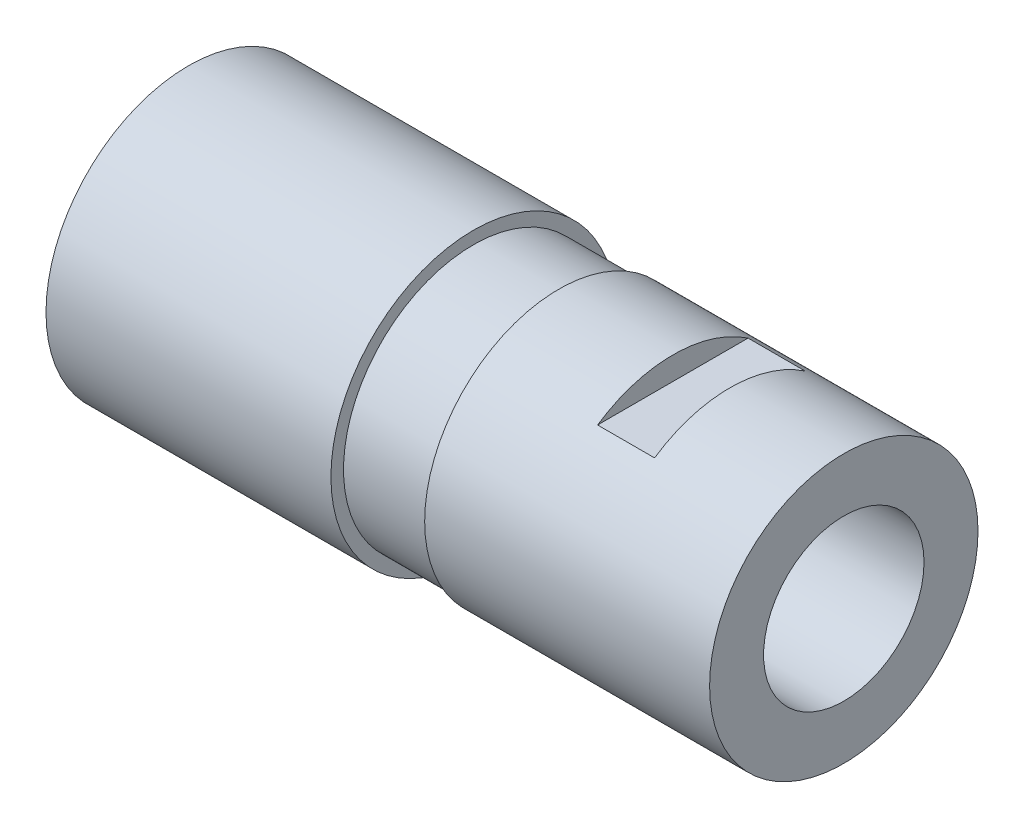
ISO-10303-21;
HEADER;
FILE_DESCRIPTION(('STEP AP214'),'2;1');
FILE_NAME('part.step','',(''),(''),'','','');
FILE_SCHEMA(('AUTOMOTIVE_DESIGN { 1 0 10303 214 1 1 1 1 }'));
ENDSEC;
DATA;
#1=APPLICATION_CONTEXT('core data for automotive mechanical design processes');
#2=APPLICATION_PROTOCOL_DEFINITION('international standard','automotive_design',2000,#1);
#3=PRODUCT_CONTEXT('',#1,'mechanical');
#4=PRODUCT('Part','Part','',(#3));
#5=PRODUCT_RELATED_PRODUCT_CATEGORY('part','',(#4));
#6=PRODUCT_DEFINITION_FORMATION('','',#4);
#7=PRODUCT_DEFINITION_CONTEXT('part definition',#1,'design');
#8=PRODUCT_DEFINITION('design','',#6,#7);
#9=PRODUCT_DEFINITION_SHAPE('','',#8);
#10=(LENGTH_UNIT() NAMED_UNIT(*) SI_UNIT(.MILLI.,.METRE.));
#11=(NAMED_UNIT(*) PLANE_ANGLE_UNIT() SI_UNIT($,.RADIAN.));
#12=(NAMED_UNIT(*) SI_UNIT($,.STERADIAN.) SOLID_ANGLE_UNIT());
#13=UNCERTAINTY_MEASURE_WITH_UNIT(LENGTH_MEASURE(1.E-05),#10,'distance_accuracy_value','');
#14=(GEOMETRIC_REPRESENTATION_CONTEXT(3) GLOBAL_UNCERTAINTY_ASSIGNED_CONTEXT((#13)) GLOBAL_UNIT_ASSIGNED_CONTEXT((#10,
#11,#12)) REPRESENTATION_CONTEXT('',''));
#15=CARTESIAN_POINT('',(0.,0.,0.));
#16=DIRECTION('',(0.,0.,1.));
#17=DIRECTION('',(1.,0.,0.));
#18=AXIS2_PLACEMENT_3D('',#15,#16,#17);
#19=CARTESIAN_POINT('',(2.57998034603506,0.,0.));
#20=DIRECTION('',(1.,0.,0.));
#21=DIRECTION('',(0.,0.,-1.));
#22=AXIS2_PLACEMENT_3D('',#19,#20,#21);
#23=CYLINDRICAL_SURFACE('',#22,5.9817);
#24=DIRECTION('',(1.,0.,0.));
#25=VECTOR('',#24,1.);
#26=CARTESIAN_POINT('',(2.57998034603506,4.953,3.35388221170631));
#27=LINE('',#26,#25);
#28=CARTESIAN_POINT('',(-7.62,4.953,3.35388221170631));
#29=VERTEX_POINT('',#28);
#30=CARTESIAN_POINT('',(-5.08,4.953,3.35388221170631));
#31=VERTEX_POINT('',#30);
#32=EDGE_CURVE('E57',#29,#31,#27,.T.);
#33=ORIENTED_EDGE('',*,*,#32,.F.);
#34=CARTESIAN_POINT('',(-7.61999999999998,0.,0.));
#35=DIRECTION('',(1.,0.,0.));
#36=DIRECTION('',(0.,1.,0.));
#37=AXIS2_PLACEMENT_3D('',#34,#35,#36);
#38=CIRCLE('',#37,5.9817);
#39=CARTESIAN_POINT('',(-7.62,4.953,-3.35388221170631));
#40=VERTEX_POINT('',#39);
#41=EDGE_CURVE('E102',#40,#29,#38,.T.);
#42=ORIENTED_EDGE('',*,*,#41,.F.);
#43=DIRECTION('',(1.,0.,0.));
#44=VECTOR('',#43,1.);
#45=CARTESIAN_POINT('',(2.57998034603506,4.953,-3.35388221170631));
#46=LINE('',#45,#44);
#47=CARTESIAN_POINT('',(-5.08,4.953,-3.35388221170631));
#48=VERTEX_POINT('',#47);
#49=EDGE_CURVE('E80',#40,#48,#46,.T.);
#50=ORIENTED_EDGE('',*,*,#49,.T.);
#51=CARTESIAN_POINT('',(-5.07999999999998,0.,0.));
#52=DIRECTION('',(-1.,0.,0.));
#53=DIRECTION('',(0.,-1.,0.));
#54=AXIS2_PLACEMENT_3D('',#51,#52,#53);
#55=CIRCLE('',#54,5.9817);
#56=EDGE_CURVE('E99',#31,#48,#55,.T.);
#57=ORIENTED_EDGE('',*,*,#56,.F.);
#58=EDGE_LOOP('',(#33,#42,#50,#57));
#59=FACE_BOUND('',#58,.T.);
#60=CARTESIAN_POINT('',(-12.7,0.,0.));
#61=DIRECTION('',(1.,0.,0.));
#62=DIRECTION('',(0.,0.,-1.));
#63=AXIS2_PLACEMENT_3D('',#60,#61,#62);
#64=CIRCLE('',#63,5.9817);
#65=CARTESIAN_POINT('',(-12.7,0.,-5.9817));
#66=VERTEX_POINT('',#65);
#67=EDGE_CURVE('E130',#66,#66,#64,.T.);
#68=ORIENTED_EDGE('',*,*,#67,.T.);
#69=EDGE_LOOP('',(#68));
#70=FACE_BOUND('',#69,.T.);
#71=CARTESIAN_POINT('',(0.,0.,0.));
#72=DIRECTION('',(1.,0.,0.));
#73=DIRECTION('',(0.,0.,-1.));
#74=AXIS2_PLACEMENT_3D('',#71,#72,#73);
#75=CIRCLE('',#74,5.9817);
#76=CARTESIAN_POINT('',(0.,0.,-5.9817));
#77=VERTEX_POINT('',#76);
#78=EDGE_CURVE('E43',#77,#77,#75,.T.);
#79=ORIENTED_EDGE('',*,*,#78,.F.);
#80=EDGE_LOOP('',(#79));
#81=FACE_BOUND('',#80,.T.);
#82=CARTESIAN_POINT('',(-5.07999999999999,0.,0.));
#83=DIRECTION('',(-1.,0.,0.));
#84=DIRECTION('',(0.,-1.,0.));
#85=AXIS2_PLACEMENT_3D('',#82,#83,#84);
#86=CIRCLE('',#85,5.9817);
#87=CARTESIAN_POINT('',(-5.08,-4.953,-3.35388221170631));
#88=VERTEX_POINT('',#87);
#89=CARTESIAN_POINT('',(-5.08,-4.953,3.35388221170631));
#90=VERTEX_POINT('',#89);
#91=EDGE_CURVE('E49',#88,#90,#86,.T.);
#92=ORIENTED_EDGE('',*,*,#91,.F.);
#93=DIRECTION('',(1.,0.,0.));
#94=VECTOR('',#93,1.);
#95=CARTESIAN_POINT('',(2.57998034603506,-4.953,-3.35388221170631));
#96=LINE('',#95,#94);
#97=CARTESIAN_POINT('',(-7.62,-4.953,-3.35388221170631));
#98=VERTEX_POINT('',#97);
#99=EDGE_CURVE('E84',#88,#98,#96,.F.);
#100=ORIENTED_EDGE('',*,*,#99,.T.);
#101=CARTESIAN_POINT('',(-7.61999999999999,0.,0.));
#102=DIRECTION('',(1.,0.,0.));
#103=DIRECTION('',(0.,1.,0.));
#104=AXIS2_PLACEMENT_3D('',#101,#102,#103);
#105=CIRCLE('',#104,5.9817);
#106=CARTESIAN_POINT('',(-7.62,-4.953,3.35388221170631));
#107=VERTEX_POINT('',#106);
#108=EDGE_CURVE('E92',#107,#98,#105,.T.);
#109=ORIENTED_EDGE('',*,*,#108,.F.);
#110=DIRECTION('',(1.,0.,0.));
#111=VECTOR('',#110,1.);
#112=CARTESIAN_POINT('',(2.57998034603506,-4.953,3.35388221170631));
#113=LINE('',#112,#111);
#114=EDGE_CURVE('E90',#90,#107,#113,.F.);
#115=ORIENTED_EDGE('',*,*,#114,.F.);
#116=EDGE_LOOP('',(#92,#100,#109,#115));
#117=FACE_BOUND('',#116,.T.);
#118=ADVANCED_FACE('F35',(#59,#70,#81,#117),#23,.T.);
#119=CARTESIAN_POINT('',(2.57998034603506,0.,0.));
#120=DIRECTION('',(1.,0.,0.));
#121=DIRECTION('',(0.,0.,-1.));
#122=AXIS2_PLACEMENT_3D('',#119,#120,#121);
#123=CYLINDRICAL_SURFACE('',#122,3.57632);
#124=CARTESIAN_POINT('',(0.,0.,0.));
#125=DIRECTION('',(1.,0.,0.));
#126=DIRECTION('',(0.,0.,-1.));
#127=AXIS2_PLACEMENT_3D('',#124,#125,#126);
#128=CIRCLE('',#127,3.57632);
#129=CARTESIAN_POINT('',(0.,0.,-3.57632));
#130=VERTEX_POINT('',#129);
#131=EDGE_CURVE('E11',#130,#130,#128,.T.);
#132=ORIENTED_EDGE('',*,*,#131,.T.);
#133=EDGE_LOOP('',(#132));
#134=FACE_BOUND('',#133,.T.);
#135=CARTESIAN_POINT('',(-11.1125,0.,0.));
#136=DIRECTION('',(1.,0.,0.));
#137=DIRECTION('',(0.,0.,-1.));
#138=AXIS2_PLACEMENT_3D('',#135,#136,#137);
#139=CIRCLE('',#138,3.57632);
#140=CARTESIAN_POINT('',(-11.1125,0.,-3.57632));
#141=VERTEX_POINT('',#140);
#142=EDGE_CURVE('E109',#141,#141,#139,.T.);
#143=ORIENTED_EDGE('',*,*,#142,.F.);
#144=EDGE_LOOP('',(#143));
#145=FACE_BOUND('',#144,.T.);
#146=ADVANCED_FACE('F37',(#134,#145),#123,.F.);
#147=CARTESIAN_POINT('',(0.,3.57632,0.));
#148=DIRECTION('',(1.,0.,0.));
#149=DIRECTION('',(0.,0.,-1.));
#150=AXIS2_PLACEMENT_3D('',#147,#148,#149);
#151=PLANE('',#150);
#152=ORIENTED_EDGE('',*,*,#78,.T.);
#153=EDGE_LOOP('',(#152));
#154=FACE_BOUND('',#153,.T.);
#155=ORIENTED_EDGE('',*,*,#131,.F.);
#156=EDGE_LOOP('',(#155));
#157=FACE_BOUND('',#156,.T.);
#158=ADVANCED_FACE('F135',(#154,#157),#151,.T.);
#159=CARTESIAN_POINT('',(-12.7,5.9817,0.));
#160=DIRECTION('',(-1.,0.,0.));
#161=DIRECTION('',(0.,0.,1.));
#162=AXIS2_PLACEMENT_3D('',#159,#160,#161);
#163=PLANE('',#162);
#164=CARTESIAN_POINT('',(-12.7,0.,0.));
#165=DIRECTION('',(1.,0.,0.));
#166=DIRECTION('',(0.,0.,-1.));
#167=AXIS2_PLACEMENT_3D('',#164,#165,#166);
#168=CIRCLE('',#167,5.78854737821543);
#169=CARTESIAN_POINT('',(-12.7,0.,-5.78854737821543));
#170=VERTEX_POINT('',#169);
#171=EDGE_CURVE('E127',#170,#170,#168,.T.);
#172=ORIENTED_EDGE('',*,*,#171,.T.);
#173=EDGE_LOOP('',(#172));
#174=FACE_BOUND('',#173,.T.);
#175=ORIENTED_EDGE('',*,*,#67,.F.);
#176=EDGE_LOOP('',(#175));
#177=FACE_BOUND('',#176,.T.);
#178=ADVANCED_FACE('F147',(#174,#177),#163,.T.);
#179=CARTESIAN_POINT('',(2.57998034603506,0.,0.));
#180=DIRECTION('',(1.,0.,0.));
#181=DIRECTION('',(0.,0.,-1.));
#182=AXIS2_PLACEMENT_3D('',#179,#180,#181);
#183=CYLINDRICAL_SURFACE('',#182,5.78854737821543);
#184=CARTESIAN_POINT('',(-16.51,0.,0.));
#185=DIRECTION('',(1.,0.,0.));
#186=DIRECTION('',(0.,0.,-1.));
#187=AXIS2_PLACEMENT_3D('',#184,#185,#186);
#188=CIRCLE('',#187,5.78854737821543);
#189=CARTESIAN_POINT('',(-16.51,0.,-5.78854737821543));
#190=VERTEX_POINT('',#189);
#191=EDGE_CURVE('E124',#190,#190,#188,.T.);
#192=ORIENTED_EDGE('',*,*,#191,.T.);
#193=EDGE_LOOP('',(#192));
#194=FACE_BOUND('',#193,.T.);
#195=ORIENTED_EDGE('',*,*,#171,.F.);
#196=EDGE_LOOP('',(#195));
#197=FACE_BOUND('',#196,.T.);
#198=ADVANCED_FACE('F153',(#194,#197),#183,.T.);
#199=CARTESIAN_POINT('',(-16.51,5.78854737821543,0.));
#200=DIRECTION('',(1.,0.,0.));
#201=DIRECTION('',(0.,0.,-1.));
#202=AXIS2_PLACEMENT_3D('',#199,#200,#201);
#203=PLANE('',#202);
#204=CARTESIAN_POINT('',(-16.51,0.,0.));
#205=DIRECTION('',(1.,0.,0.));
#206=DIRECTION('',(0.,0.,-1.));
#207=AXIS2_PLACEMENT_3D('',#204,#205,#206);
#208=CIRCLE('',#207,6.35);
#209=CARTESIAN_POINT('',(-16.51,0.,-6.35));
#210=VERTEX_POINT('',#209);
#211=EDGE_CURVE('E121',#210,#210,#208,.T.);
#212=ORIENTED_EDGE('',*,*,#211,.T.);
#213=EDGE_LOOP('',(#212));
#214=FACE_BOUND('',#213,.T.);
#215=ORIENTED_EDGE('',*,*,#191,.F.);
#216=EDGE_LOOP('',(#215));
#217=FACE_BOUND('',#216,.T.);
#218=ADVANCED_FACE('F158',(#214,#217),#203,.T.);
#219=CARTESIAN_POINT('',(2.57998034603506,0.,0.));
#220=DIRECTION('',(1.,0.,0.));
#221=DIRECTION('',(0.,0.,-1.));
#222=AXIS2_PLACEMENT_3D('',#219,#220,#221);
#223=CYLINDRICAL_SURFACE('',#222,6.35);
#224=CARTESIAN_POINT('',(-29.21,0.,0.));
#225=DIRECTION('',(1.,0.,0.));
#226=DIRECTION('',(0.,0.,-1.));
#227=AXIS2_PLACEMENT_3D('',#224,#225,#226);
#228=CIRCLE('',#227,6.35);
#229=CARTESIAN_POINT('',(-29.21,0.,-6.35));
#230=VERTEX_POINT('',#229);
#231=EDGE_CURVE('E118',#230,#230,#228,.T.);
#232=ORIENTED_EDGE('',*,*,#231,.T.);
#233=EDGE_LOOP('',(#232));
#234=FACE_BOUND('',#233,.T.);
#235=ORIENTED_EDGE('',*,*,#211,.F.);
#236=EDGE_LOOP('',(#235));
#237=FACE_BOUND('',#236,.T.);
#238=ADVANCED_FACE('F167',(#234,#237),#223,.T.);
#239=CARTESIAN_POINT('',(-29.21,6.35,0.));
#240=DIRECTION('',(-1.,0.,0.));
#241=DIRECTION('',(0.,0.,1.));
#242=AXIS2_PLACEMENT_3D('',#239,#240,#241);
#243=PLANE('',#242);
#244=CARTESIAN_POINT('',(-29.21,0.,0.));
#245=DIRECTION('',(1.,0.,0.));
#246=DIRECTION('',(0.,0.,-1.));
#247=AXIS2_PLACEMENT_3D('',#244,#245,#246);
#248=CIRCLE('',#247,3.175);
#249=CARTESIAN_POINT('',(-29.21,0.,-3.175));
#250=VERTEX_POINT('',#249);
#251=EDGE_CURVE('E115',#250,#250,#248,.T.);
#252=ORIENTED_EDGE('',*,*,#251,.T.);
#253=EDGE_LOOP('',(#252));
#254=FACE_BOUND('',#253,.T.);
#255=ORIENTED_EDGE('',*,*,#231,.F.);
#256=EDGE_LOOP('',(#255));
#257=FACE_BOUND('',#256,.T.);
#258=ADVANCED_FACE('F173',(#254,#257),#243,.T.);
#259=CARTESIAN_POINT('',(2.57998034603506,0.,0.));
#260=DIRECTION('',(1.,0.,0.));
#261=DIRECTION('',(0.,0.,-1.));
#262=AXIS2_PLACEMENT_3D('',#259,#260,#261);
#263=CYLINDRICAL_SURFACE('',#262,3.175);
#264=CARTESIAN_POINT('',(-11.1125,0.,0.));
#265=DIRECTION('',(1.,0.,0.));
#266=DIRECTION('',(0.,0.,-1.));
#267=AXIS2_PLACEMENT_3D('',#264,#265,#266);
#268=CIRCLE('',#267,3.175);
#269=CARTESIAN_POINT('',(-11.1125,0.,-3.175));
#270=VERTEX_POINT('',#269);
#271=EDGE_CURVE('E112',#270,#270,#268,.T.);
#272=ORIENTED_EDGE('',*,*,#271,.T.);
#273=EDGE_LOOP('',(#272));
#274=FACE_BOUND('',#273,.T.);
#275=ORIENTED_EDGE('',*,*,#251,.F.);
#276=EDGE_LOOP('',(#275));
#277=FACE_BOUND('',#276,.T.);
#278=ADVANCED_FACE('F177',(#274,#277),#263,.F.);
#279=CARTESIAN_POINT('',(-11.1125,3.57632,0.));
#280=DIRECTION('',(1.,0.,0.));
#281=DIRECTION('',(0.,0.,-1.));
#282=AXIS2_PLACEMENT_3D('',#279,#280,#281);
#283=PLANE('',#282);
#284=ORIENTED_EDGE('',*,*,#142,.T.);
#285=EDGE_LOOP('',(#284));
#286=FACE_BOUND('',#285,.T.);
#287=ORIENTED_EDGE('',*,*,#271,.F.);
#288=EDGE_LOOP('',(#287));
#289=FACE_BOUND('',#288,.T.);
#290=ADVANCED_FACE('F181',(#286,#289),#283,.T.);
#291=CARTESIAN_POINT('',(-7.62,5.9817,6.351));
#292=DIRECTION('',(1.,0.,0.));
#293=DIRECTION('',(0.,1.,0.));
#294=AXIS2_PLACEMENT_3D('',#291,#292,#293);
#295=PLANE('',#294);
#296=ORIENTED_EDGE('',*,*,#41,.T.);
#297=DIRECTION('',(0.,0.,-1.));
#298=VECTOR('',#297,1.);
#299=CARTESIAN_POINT('',(-7.62,4.953,6.351));
#300=LINE('',#299,#298);
#301=EDGE_CURVE('E107',#29,#40,#300,.T.);
#302=ORIENTED_EDGE('',*,*,#301,.T.);
#303=EDGE_LOOP('',(#296,#302));
#304=FACE_BOUND('',#303,.T.);
#305=ADVANCED_FACE('F185',(#304),#295,.T.);
#306=CARTESIAN_POINT('',(-7.62,4.953,6.351));
#307=DIRECTION('',(0.,1.,0.));
#308=DIRECTION('',(0.,0.,1.));
#309=AXIS2_PLACEMENT_3D('',#306,#307,#308);
#310=PLANE('',#309);
#311=ORIENTED_EDGE('',*,*,#32,.T.);
#312=DIRECTION('',(0.,0.,-1.));
#313=VECTOR('',#312,1.);
#314=CARTESIAN_POINT('',(-5.08,4.953,6.351));
#315=LINE('',#314,#313);
#316=EDGE_CURVE('E105',#31,#48,#315,.T.);
#317=ORIENTED_EDGE('',*,*,#316,.T.);
#318=ORIENTED_EDGE('',*,*,#49,.F.);
#319=ORIENTED_EDGE('',*,*,#301,.F.);
#320=EDGE_LOOP('',(#311,#317,#318,#319));
#321=FACE_BOUND('',#320,.T.);
#322=ADVANCED_FACE('F189',(#321),#310,.T.);
#323=CARTESIAN_POINT('',(-5.08,5.9817,6.351));
#324=DIRECTION('',(-1.,0.,0.));
#325=DIRECTION('',(0.,-1.,0.));
#326=AXIS2_PLACEMENT_3D('',#323,#324,#325);
#327=PLANE('',#326);
#328=ORIENTED_EDGE('',*,*,#56,.T.);
#329=ORIENTED_EDGE('',*,*,#316,.F.);
#330=EDGE_LOOP('',(#328,#329));
#331=FACE_BOUND('',#330,.T.);
#332=ADVANCED_FACE('F193',(#331),#327,.T.);
#333=CARTESIAN_POINT('',(-7.62,-5.9817,6.351));
#334=DIRECTION('',(1.,0.,0.));
#335=DIRECTION('',(0.,1.,0.));
#336=AXIS2_PLACEMENT_3D('',#333,#334,#335);
#337=PLANE('',#336);
#338=ORIENTED_EDGE('',*,*,#108,.T.);
#339=DIRECTION('',(0.,0.,-1.));
#340=VECTOR('',#339,1.);
#341=CARTESIAN_POINT('',(-7.62,-4.953,6.351));
#342=LINE('',#341,#340);
#343=EDGE_CURVE('E81',#107,#98,#342,.T.);
#344=ORIENTED_EDGE('',*,*,#343,.F.);
#345=EDGE_LOOP('',(#338,#344));
#346=FACE_BOUND('',#345,.T.);
#347=ADVANCED_FACE('F196',(#346),#337,.T.);
#348=CARTESIAN_POINT('',(-5.08,-5.9817,6.351));
#349=DIRECTION('',(-1.,0.,0.));
#350=DIRECTION('',(0.,-1.,0.));
#351=AXIS2_PLACEMENT_3D('',#348,#349,#350);
#352=PLANE('',#351);
#353=ORIENTED_EDGE('',*,*,#91,.T.);
#354=DIRECTION('',(0.,0.,-1.));
#355=VECTOR('',#354,1.);
#356=CARTESIAN_POINT('',(-5.08,-4.953,6.351));
#357=LINE('',#356,#355);
#358=EDGE_CURVE('E74',#90,#88,#357,.T.);
#359=ORIENTED_EDGE('',*,*,#358,.T.);
#360=EDGE_LOOP('',(#353,#359));
#361=FACE_BOUND('',#360,.T.);
#362=ADVANCED_FACE('F76',(#361),#352,.T.);
#363=CARTESIAN_POINT('',(-7.62,-4.953,6.351));
#364=DIRECTION('',(0.,-1.,0.));
#365=DIRECTION('',(0.,0.,-1.));
#366=AXIS2_PLACEMENT_3D('',#363,#364,#365);
#367=PLANE('',#366);
#368=ORIENTED_EDGE('',*,*,#114,.T.);
#369=ORIENTED_EDGE('',*,*,#343,.T.);
#370=ORIENTED_EDGE('',*,*,#99,.F.);
#371=ORIENTED_EDGE('',*,*,#358,.F.);
#372=EDGE_LOOP('',(#368,#369,#370,#371));
#373=FACE_BOUND('',#372,.T.);
#374=ADVANCED_FACE('F85',(#373),#367,.T.);
#375=CLOSED_SHELL('',(#118,#146,#158,#178,#198,#218,#238,#258,#278,#290,#305,#322,#332,#347,
#362,#374));
#376=MANIFOLD_SOLID_BREP('B2',#375);
#377=ADVANCED_BREP_SHAPE_REPRESENTATION('',(#18,#376),#14);
#378=SHAPE_DEFINITION_REPRESENTATION(#9,#377);
ENDSEC;
END-ISO-10303-21;
